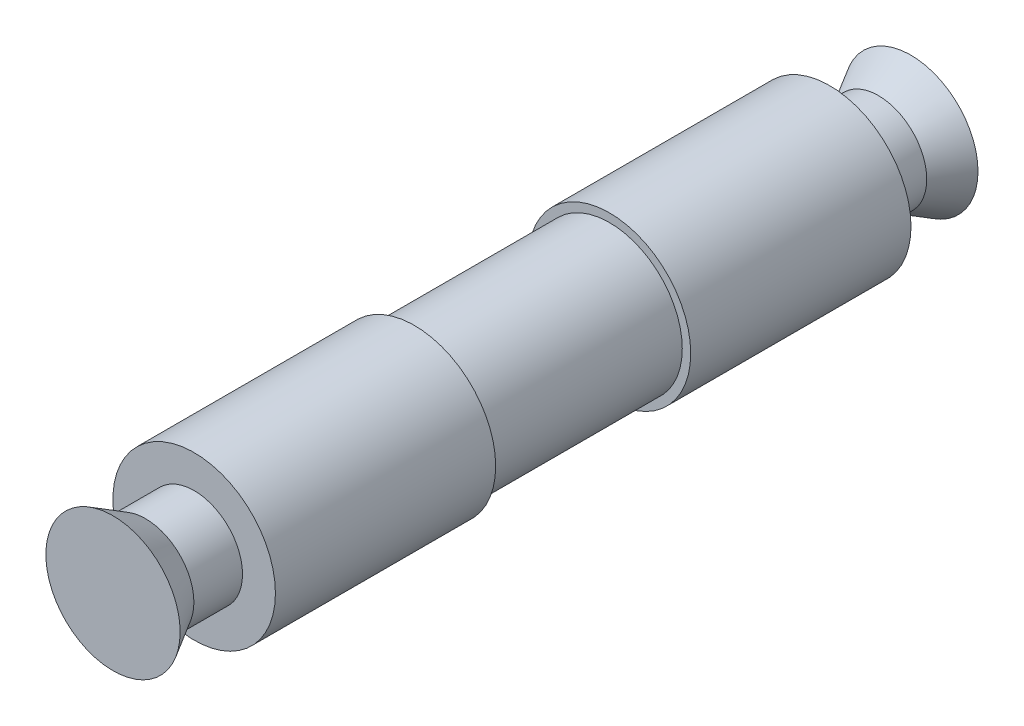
from build123d import *


with BuildPart() as part:
    # Sketch 1 → Revolve 1 (revolve)
    with BuildSketch(Plane(origin=(0, 0, 0), x_dir=(0, 0, -1), z_dir=(1, 0, 0)), mode=Mode.PRIVATE) as revolve_1_sk:
        Polygon((0, 0), (38.9636, 0), (38.9636, 3.278743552), (37.3761, 2.3622), (35.0012, 2.3622), (35.0012, 3.96875), (24.2443, 3.96875), (24.2443, 3.556), (14.7193, 3.556), (14.7193, 3.96875), (3.9624, 3.96875), (3.9624, 2.3622), (1.5875, 2.3622), (0, 3.278743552), align=None)
    revolve(revolve_1_sk.sketch.rotate(Axis((0, 0, 0), (0, 0, -1)), 90), axis=Axis((0, 0, 0), (0, 0, -1)))


solid = part.part
